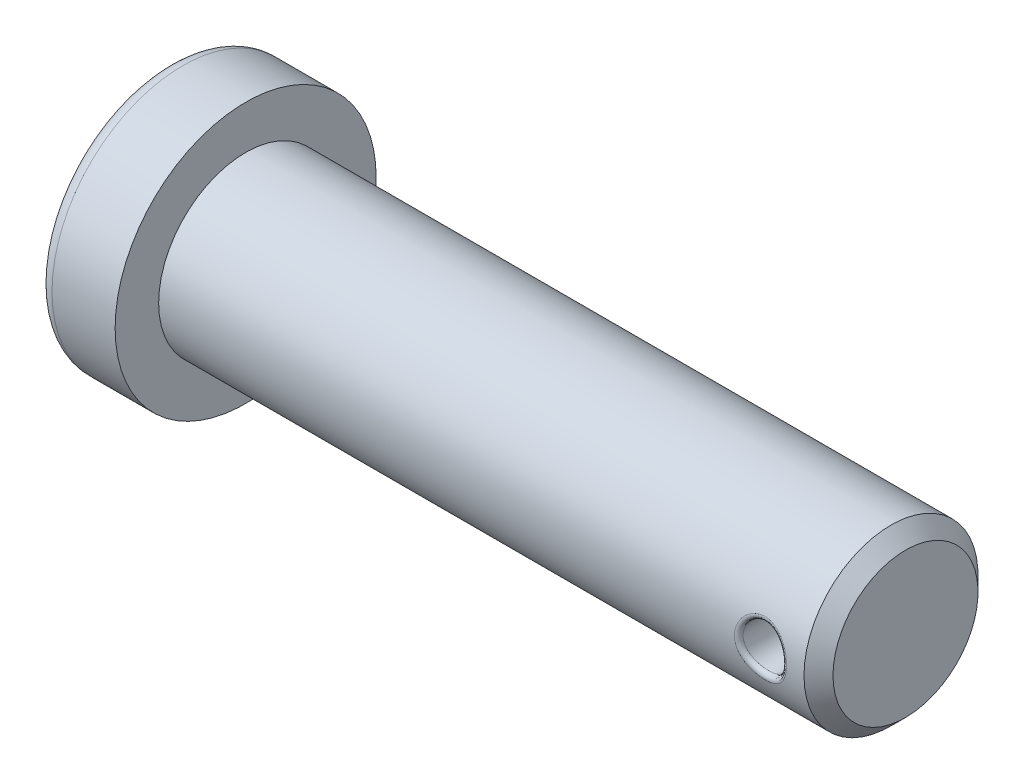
from build123d import *

# Parameters (mm, degrees)
ENL_V_MAT_EXTRU_1_DEPTH      = 37.607125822
ENL_V_MAT_EXTRU_1_DEPTH_BACK = 37.607125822
ESQUISSE2_R                  = 1.5
CONG_1_R                     = 0.3
D_ME1_FACE_RADIUS            = 9
D_ME1_HEIGHT                 = 2
CONG_2_R                     = 1


with BuildPart() as part:
    # Esquisse1 → R_volution1 (revolve)
    with BuildSketch(Plane.XY, mode=Mode.PRIVATE) as r_volution1_sk:
        Polygon((34.323194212, 0), (34.323194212, 5), (33.323194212, 6), (-11.176805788, 6), (-11.176805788, 9), (-16.176805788, 9), (-16.176805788, 0), align=None)
    revolve(r_volution1_sk.sketch.rotate(Axis((-48.632156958, 0, 0), (1, 0, 0)), 90), axis=Axis((-48.632156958, 0, 0), (1, 0, 0)))

    # Esquisse2 → Enl_v. mat.-Extru.1 (cut, two sides: drawn at the far end of the back side and taken through both)
    with BuildSketch(Plane.XY.offset(-ENL_V_MAT_EXTRU_1_DEPTH_BACK)):
        with Locations((30.323194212, 0)):
            Circle(ESQUISSE2_R)
    extrude(amount=ENL_V_MAT_EXTRU_1_DEPTH + ENL_V_MAT_EXTRU_1_DEPTH_BACK, mode=Mode.SUBTRACT)

    # Cong_1
    cong_1_edges = [part.edges().sort_by_distance(p)[0] for p in [
        (28.823194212, 0, -6),
        (30.323194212, 1.5, 5.809475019),
    ]]
    fillet(cong_1_edges, radius=CONG_1_R)

    # D_me1: a dome of height H over a round flat face of radius A is a cap of a sphere of radius (A * A + H * H) / (2 * H)
    d_me1_r = (D_ME1_FACE_RADIUS * D_ME1_FACE_RADIUS + D_ME1_HEIGHT * D_ME1_HEIGHT) / (2 * D_ME1_HEIGHT)
    d_me1_base = Plane((-16.176805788, 0, 0), z_dir=(-1, 0, 0))
    with Locations(d_me1_base.offset(D_ME1_HEIGHT - d_me1_r)):
        d_me1_ball = Sphere(d_me1_r, mode=Mode.PRIVATE)
    add(split(d_me1_ball, bisect_by=d_me1_base, keep=Keep.TOP, mode=Mode.PRIVATE))

    # Cong_2
    cong_2_edges = [part.edges().sort_by_distance(p)[0] for p in [
        (-16.176805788, -9, 0),
    ]]
    fillet(cong_2_edges, radius=CONG_2_R)


solid = part.part
